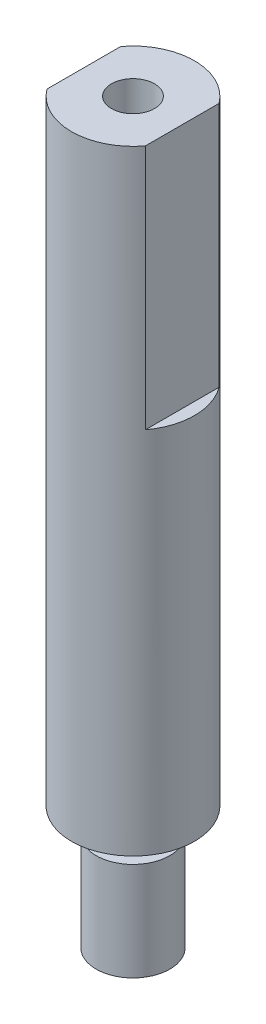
ISO-10303-21;
HEADER;
FILE_DESCRIPTION(('STEP AP214'),'2;1');
FILE_NAME('part.step','',(''),(''),'','','');
FILE_SCHEMA(('AUTOMOTIVE_DESIGN { 1 0 10303 214 1 1 1 1 }'));
ENDSEC;
DATA;
#1=APPLICATION_CONTEXT('core data for automotive mechanical design processes');
#2=APPLICATION_PROTOCOL_DEFINITION('international standard','automotive_design',2000,#1);
#3=PRODUCT_CONTEXT('',#1,'mechanical');
#4=PRODUCT('Part','Part','',(#3));
#5=PRODUCT_RELATED_PRODUCT_CATEGORY('part','',(#4));
#6=PRODUCT_DEFINITION_FORMATION('','',#4);
#7=PRODUCT_DEFINITION_CONTEXT('part definition',#1,'design');
#8=PRODUCT_DEFINITION('design','',#6,#7);
#9=PRODUCT_DEFINITION_SHAPE('','',#8);
#10=(LENGTH_UNIT() NAMED_UNIT(*) SI_UNIT(.MILLI.,.METRE.));
#11=(NAMED_UNIT(*) PLANE_ANGLE_UNIT() SI_UNIT($,.RADIAN.));
#12=(NAMED_UNIT(*) SI_UNIT($,.STERADIAN.) SOLID_ANGLE_UNIT());
#13=UNCERTAINTY_MEASURE_WITH_UNIT(LENGTH_MEASURE(1.E-05),#10,'distance_accuracy_value','');
#14=(GEOMETRIC_REPRESENTATION_CONTEXT(3) GLOBAL_UNCERTAINTY_ASSIGNED_CONTEXT((#13)) GLOBAL_UNIT_ASSIGNED_CONTEXT((#10,
#11,#12)) REPRESENTATION_CONTEXT('',''));
#15=CARTESIAN_POINT('',(0.,0.,0.));
#16=DIRECTION('',(0.,0.,1.));
#17=DIRECTION('',(1.,0.,0.));
#18=AXIS2_PLACEMENT_3D('',#15,#16,#17);
#19=CARTESIAN_POINT('',(0.,0.,0.));
#20=DIRECTION('',(0.,1.,0.));
#21=DIRECTION('',(0.,0.,1.));
#22=AXIS2_PLACEMENT_3D('',#19,#20,#21);
#23=PLANE('',#22);
#24=CARTESIAN_POINT('',(0.,0.,0.));
#25=DIRECTION('',(0.,1.,0.));
#26=DIRECTION('',(0.,0.,1.));
#27=AXIS2_PLACEMENT_3D('',#24,#25,#26);
#28=CIRCLE('',#27,2.5);
#29=CARTESIAN_POINT('',(0.,0.,2.5));
#30=VERTEX_POINT('',#29);
#31=EDGE_CURVE('E54',#30,#30,#28,.T.);
#32=ORIENTED_EDGE('',*,*,#31,.F.);
#33=EDGE_LOOP('',(#32));
#34=FACE_BOUND('',#33,.T.);
#35=CARTESIAN_POINT('',(0.,0.,0.));
#36=DIRECTION('',(0.,1.,0.));
#37=DIRECTION('',(0.,0.,1.));
#38=AXIS2_PLACEMENT_3D('',#35,#36,#37);
#39=CIRCLE('',#38,1.);
#40=CARTESIAN_POINT('',(0.,0.,1.));
#41=VERTEX_POINT('',#40);
#42=EDGE_CURVE('E13',#41,#41,#39,.F.);
#43=ORIENTED_EDGE('',*,*,#42,.F.);
#44=EDGE_LOOP('',(#43));
#45=FACE_BOUND('',#44,.T.);
#46=ADVANCED_FACE('F47',(#34,#45),#23,.F.);
#47=CARTESIAN_POINT('',(0.,52.9432015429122,0.));
#48=DIRECTION('',(0.,1.,0.));
#49=DIRECTION('',(0.,0.,1.));
#50=AXIS2_PLACEMENT_3D('',#47,#48,#49);
#51=CYLINDRICAL_SURFACE('',#50,2.5);
#52=ORIENTED_EDGE('',*,*,#31,.T.);
#53=EDGE_LOOP('',(#52));
#54=FACE_BOUND('',#53,.T.);
#55=DIRECTION('',(0.,1.,0.));
#56=VECTOR('',#55,1.);
#57=CARTESIAN_POINT('',(-1.99987881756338,15.,1.50016156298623));
#58=LINE('',#57,#56);
#59=CARTESIAN_POINT('',(-1.99987881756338,15.,1.50016156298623));
#60=VERTEX_POINT('',#59);
#61=CARTESIAN_POINT('',(-1.99987881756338,25.,1.50016156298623));
#62=VERTEX_POINT('',#61);
#63=EDGE_CURVE('E61',#60,#62,#58,.T.);
#64=ORIENTED_EDGE('',*,*,#63,.F.);
#65=CARTESIAN_POINT('',(0.,15.,0.));
#66=DIRECTION('',(0.,1.,0.));
#67=DIRECTION('',(0.,0.,1.));
#68=AXIS2_PLACEMENT_3D('',#65,#66,#67);
#69=CIRCLE('',#68,2.5);
#70=CARTESIAN_POINT('',(-1.99987881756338,15.,-1.50016156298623));
#71=VERTEX_POINT('',#70);
#72=EDGE_CURVE('E112',#71,#60,#69,.T.);
#73=ORIENTED_EDGE('',*,*,#72,.F.);
#74=DIRECTION('',(0.,1.,0.));
#75=VECTOR('',#74,1.);
#76=CARTESIAN_POINT('',(-1.99987881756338,15.,-1.50016156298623));
#77=LINE('',#76,#75);
#78=CARTESIAN_POINT('',(-1.99987881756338,25.,-1.50016156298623));
#79=VERTEX_POINT('',#78);
#80=EDGE_CURVE('E115',#71,#79,#77,.T.);
#81=ORIENTED_EDGE('',*,*,#80,.T.);
#82=CARTESIAN_POINT('',(0.,25.,0.));
#83=DIRECTION('',(0.,1.,0.));
#84=DIRECTION('',(0.,0.,1.));
#85=AXIS2_PLACEMENT_3D('',#82,#83,#84);
#86=CIRCLE('',#85,2.5);
#87=CARTESIAN_POINT('',(2.00334876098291,25.,-1.49552457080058));
#88=VERTEX_POINT('',#87);
#89=EDGE_CURVE('E132',#88,#79,#86,.T.);
#90=ORIENTED_EDGE('',*,*,#89,.F.);
#91=DIRECTION('',(0.,1.,0.));
#92=VECTOR('',#91,1.);
#93=CARTESIAN_POINT('',(2.00334876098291,15.,-1.49552457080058));
#94=LINE('',#93,#92);
#95=CARTESIAN_POINT('',(2.00334876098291,15.,-1.49552457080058));
#96=VERTEX_POINT('',#95);
#97=EDGE_CURVE('E69',#96,#88,#94,.T.);
#98=ORIENTED_EDGE('',*,*,#97,.F.);
#99=CARTESIAN_POINT('',(0.,15.,0.));
#100=DIRECTION('',(0.,1.,0.));
#101=DIRECTION('',(0.,0.,1.));
#102=AXIS2_PLACEMENT_3D('',#99,#100,#101);
#103=CIRCLE('',#102,2.5);
#104=CARTESIAN_POINT('',(2.00334876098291,15.,1.49552457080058));
#105=VERTEX_POINT('',#104);
#106=EDGE_CURVE('E123',#105,#96,#103,.T.);
#107=ORIENTED_EDGE('',*,*,#106,.F.);
#108=DIRECTION('',(0.,1.,0.));
#109=VECTOR('',#108,1.);
#110=CARTESIAN_POINT('',(2.00334876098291,15.,1.49552457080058));
#111=LINE('',#110,#109);
#112=CARTESIAN_POINT('',(2.00334876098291,25.,1.49552457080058));
#113=VERTEX_POINT('',#112);
#114=EDGE_CURVE('E126',#105,#113,#111,.T.);
#115=ORIENTED_EDGE('',*,*,#114,.T.);
#116=EDGE_CURVE('E129',#62,#113,#86,.T.);
#117=ORIENTED_EDGE('',*,*,#116,.F.);
#118=EDGE_LOOP('',(#64,#73,#81,#90,#98,#107,#115,#117));
#119=FACE_BOUND('',#118,.T.);
#120=ADVANCED_FACE('F137',(#54,#119),#51,.T.);
#121=CARTESIAN_POINT('',(2.5,25.,0.));
#122=DIRECTION('',(0.,-1.,0.));
#123=DIRECTION('',(0.,0.,-1.));
#124=AXIS2_PLACEMENT_3D('',#121,#122,#123);
#125=PLANE('',#124);
#126=CARTESIAN_POINT('',(0.,25.,0.));
#127=DIRECTION('',(0.,1.,0.));
#128=DIRECTION('',(0.,0.,1.));
#129=AXIS2_PLACEMENT_3D('',#126,#127,#128);
#130=CIRCLE('',#129,0.874999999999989);
#131=CARTESIAN_POINT('',(0.,25.,0.874999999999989));
#132=VERTEX_POINT('',#131);
#133=EDGE_CURVE('E99',#132,#132,#130,.T.);
#134=ORIENTED_EDGE('',*,*,#133,.F.);
#135=EDGE_LOOP('',(#134));
#136=FACE_BOUND('',#135,.T.);
#137=DIRECTION('',(0.,0.,1.));
#138=VECTOR('',#137,1.);
#139=CARTESIAN_POINT('',(-1.99987881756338,25.,0.));
#140=LINE('',#139,#138);
#141=EDGE_CURVE('E103',#79,#62,#140,.T.);
#142=ORIENTED_EDGE('',*,*,#141,.T.);
#143=ORIENTED_EDGE('',*,*,#116,.T.);
#144=DIRECTION('',(0.,0.,-1.));
#145=VECTOR('',#144,1.);
#146=CARTESIAN_POINT('',(2.00334876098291,25.,0.));
#147=LINE('',#146,#145);
#148=EDGE_CURVE('E118',#113,#88,#147,.T.);
#149=ORIENTED_EDGE('',*,*,#148,.T.);
#150=ORIENTED_EDGE('',*,*,#89,.T.);
#151=EDGE_LOOP('',(#142,#143,#149,#150));
#152=FACE_BOUND('',#151,.T.);
#153=ADVANCED_FACE('F173',(#136,#152),#125,.F.);
#154=CARTESIAN_POINT('',(2.00334876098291,15.,0.));
#155=DIRECTION('',(1.,0.,0.));
#156=DIRECTION('',(0.,0.,-1.));
#157=AXIS2_PLACEMENT_3D('',#154,#155,#156);
#158=PLANE('',#157);
#159=ORIENTED_EDGE('',*,*,#148,.F.);
#160=ORIENTED_EDGE('',*,*,#114,.F.);
#161=DIRECTION('',(0.,0.,-1.));
#162=VECTOR('',#161,1.);
#163=CARTESIAN_POINT('',(2.00334876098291,15.,0.));
#164=LINE('',#163,#162);
#165=EDGE_CURVE('E121',#105,#96,#164,.T.);
#166=ORIENTED_EDGE('',*,*,#165,.T.);
#167=ORIENTED_EDGE('',*,*,#97,.T.);
#168=EDGE_LOOP('',(#159,#160,#166,#167));
#169=FACE_BOUND('',#168,.T.);
#170=ADVANCED_FACE('F169',(#169),#158,.T.);
#171=CARTESIAN_POINT('',(-5.64142135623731,15.,0.));
#172=DIRECTION('',(0.,1.,0.));
#173=DIRECTION('',(0.,0.,1.));
#174=AXIS2_PLACEMENT_3D('',#171,#172,#173);
#175=PLANE('',#174);
#176=ORIENTED_EDGE('',*,*,#165,.F.);
#177=ORIENTED_EDGE('',*,*,#106,.T.);
#178=EDGE_LOOP('',(#176,#177));
#179=FACE_BOUND('',#178,.T.);
#180=ADVANCED_FACE('F166',(#179),#175,.T.);
#181=CARTESIAN_POINT('',(-1.99987881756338,15.,0.));
#182=DIRECTION('',(-1.,0.,0.));
#183=DIRECTION('',(0.,0.,1.));
#184=AXIS2_PLACEMENT_3D('',#181,#182,#183);
#185=PLANE('',#184);
#186=ORIENTED_EDGE('',*,*,#141,.F.);
#187=ORIENTED_EDGE('',*,*,#80,.F.);
#188=DIRECTION('',(0.,0.,1.));
#189=VECTOR('',#188,1.);
#190=CARTESIAN_POINT('',(-1.99987881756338,15.,0.));
#191=LINE('',#190,#189);
#192=EDGE_CURVE('E110',#71,#60,#191,.T.);
#193=ORIENTED_EDGE('',*,*,#192,.T.);
#194=ORIENTED_EDGE('',*,*,#63,.T.);
#195=EDGE_LOOP('',(#186,#187,#193,#194));
#196=FACE_BOUND('',#195,.T.);
#197=ADVANCED_FACE('F162',(#196),#185,.T.);
#198=CARTESIAN_POINT('',(-5.64142135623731,15.,0.));
#199=DIRECTION('',(0.,1.,0.));
#200=DIRECTION('',(0.,0.,1.));
#201=AXIS2_PLACEMENT_3D('',#198,#199,#200);
#202=PLANE('',#201);
#203=ORIENTED_EDGE('',*,*,#192,.F.);
#204=ORIENTED_EDGE('',*,*,#72,.T.);
#205=EDGE_LOOP('',(#203,#204));
#206=FACE_BOUND('',#205,.T.);
#207=ADVANCED_FACE('F159',(#206),#202,.T.);
#208=CARTESIAN_POINT('',(0.,25.,0.));
#209=DIRECTION('',(0.,1.,0.));
#210=DIRECTION('',(0.,0.,1.));
#211=AXIS2_PLACEMENT_3D('',#208,#209,#210);
#212=CYLINDRICAL_SURFACE('',#211,0.874999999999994);
#213=CARTESIAN_POINT('',(0.,21.5,0.));
#214=DIRECTION('',(0.,1.,0.));
#215=DIRECTION('',(0.,0.,1.));
#216=AXIS2_PLACEMENT_3D('',#213,#214,#215);
#217=CIRCLE('',#216,0.874999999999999);
#218=CARTESIAN_POINT('',(0.,21.5,0.874999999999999));
#219=VERTEX_POINT('',#218);
#220=EDGE_CURVE('E97',#219,#219,#217,.T.);
#221=ORIENTED_EDGE('',*,*,#220,.F.);
#222=EDGE_LOOP('',(#221));
#223=FACE_BOUND('',#222,.T.);
#224=ORIENTED_EDGE('',*,*,#133,.T.);
#225=EDGE_LOOP('',(#224));
#226=FACE_BOUND('',#225,.T.);
#227=ADVANCED_FACE('F93',(#223,#226),#212,.F.);
#228=CARTESIAN_POINT('',(0.,21.5,0.));
#229=DIRECTION('',(0.,1.,0.));
#230=DIRECTION('',(0.,0.,1.));
#231=AXIS2_PLACEMENT_3D('',#228,#229,#230);
#232=CONICAL_SURFACE('',#231,0.874999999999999,1.02974425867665);
#233=CARTESIAN_POINT('',(0.,20.9742469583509,0.));
#234=VERTEX_POINT('',#233);
#235=VERTEX_LOOP('',#234);
#236=FACE_BOUND('',#235,.T.);
#237=ORIENTED_EDGE('',*,*,#220,.T.);
#238=EDGE_LOOP('',(#237));
#239=FACE_BOUND('',#238,.T.);
#240=ADVANCED_FACE('F89',(#236,#239),#232,.F.);
#241=CARTESIAN_POINT('',(0.,-1.,0.));
#242=DIRECTION('',(0.,1.,0.));
#243=DIRECTION('',(0.,0.,1.));
#244=AXIS2_PLACEMENT_3D('',#241,#242,#243);
#245=CYLINDRICAL_SURFACE('',#244,1.);
#246=CARTESIAN_POINT('',(0.,-1.,0.));
#247=DIRECTION('',(0.,-1.,0.));
#248=DIRECTION('',(0.,0.,-1.));
#249=AXIS2_PLACEMENT_3D('',#246,#247,#248);
#250=CIRCLE('',#249,1.);
#251=CARTESIAN_POINT('',(0.,-1.,-1.));
#252=VERTEX_POINT('',#251);
#253=EDGE_CURVE('E100',#252,#252,#250,.T.);
#254=ORIENTED_EDGE('',*,*,#253,.F.);
#255=EDGE_LOOP('',(#254));
#256=FACE_BOUND('',#255,.T.);
#257=ORIENTED_EDGE('',*,*,#42,.T.);
#258=EDGE_LOOP('',(#257));
#259=FACE_BOUND('',#258,.T.);
#260=ADVANCED_FACE('F92',(#256,#259),#245,.T.);
#261=CARTESIAN_POINT('',(0.,-1.,0.));
#262=DIRECTION('',(0.,-1.,0.));
#263=DIRECTION('',(0.,0.,-1.));
#264=AXIS2_PLACEMENT_3D('',#261,#262,#263);
#265=PLANE('',#264);
#266=CARTESIAN_POINT('',(0.,-1.,0.));
#267=DIRECTION('',(0.,-1.,0.));
#268=DIRECTION('',(0.,0.,-1.));
#269=AXIS2_PLACEMENT_3D('',#266,#267,#268);
#270=CIRCLE('',#269,1.5);
#271=CARTESIAN_POINT('',(0.,-1.,-1.5));
#272=VERTEX_POINT('',#271);
#273=EDGE_CURVE('E247',#272,#272,#270,.T.);
#274=ORIENTED_EDGE('',*,*,#273,.F.);
#275=EDGE_LOOP('',(#274));
#276=FACE_BOUND('',#275,.T.);
#277=ORIENTED_EDGE('',*,*,#253,.T.);
#278=EDGE_LOOP('',(#277));
#279=FACE_BOUND('',#278,.T.);
#280=ADVANCED_FACE('F145',(#276,#279),#265,.F.);
#281=CARTESIAN_POINT('',(0.,-5.,0.));
#282=DIRECTION('',(0.,1.,0.));
#283=DIRECTION('',(0.,0.,1.));
#284=AXIS2_PLACEMENT_3D('',#281,#282,#283);
#285=CYLINDRICAL_SURFACE('',#284,1.5);
#286=CARTESIAN_POINT('',(0.,-5.,0.));
#287=DIRECTION('',(0.,-1.,0.));
#288=DIRECTION('',(0.,0.,-1.));
#289=AXIS2_PLACEMENT_3D('',#286,#287,#288);
#290=CIRCLE('',#289,1.5);
#291=CARTESIAN_POINT('',(0.,-5.,-1.5));
#292=VERTEX_POINT('',#291);
#293=EDGE_CURVE('E106',#292,#292,#290,.T.);
#294=ORIENTED_EDGE('',*,*,#293,.F.);
#295=EDGE_LOOP('',(#294));
#296=FACE_BOUND('',#295,.T.);
#297=ORIENTED_EDGE('',*,*,#273,.T.);
#298=EDGE_LOOP('',(#297));
#299=FACE_BOUND('',#298,.T.);
#300=ADVANCED_FACE('F151',(#296,#299),#285,.T.);
#301=CARTESIAN_POINT('',(0.,-5.,0.));
#302=DIRECTION('',(0.,-1.,0.));
#303=DIRECTION('',(0.,0.,-1.));
#304=AXIS2_PLACEMENT_3D('',#301,#302,#303);
#305=PLANE('',#304);
#306=ORIENTED_EDGE('',*,*,#293,.T.);
#307=EDGE_LOOP('',(#306));
#308=FACE_BOUND('',#307,.T.);
#309=ADVANCED_FACE('F232',(#308),#305,.T.);
#310=CLOSED_SHELL('',(#46,#120,#153,#170,#180,#197,#207,#227,#240,#260,#280,#300,#309));
#311=MANIFOLD_SOLID_BREP('B2',#310);
#312=ADVANCED_BREP_SHAPE_REPRESENTATION('',(#18,#311),#14);
#313=SHAPE_DEFINITION_REPRESENTATION(#9,#312);
ENDSEC;
END-ISO-10303-21;
